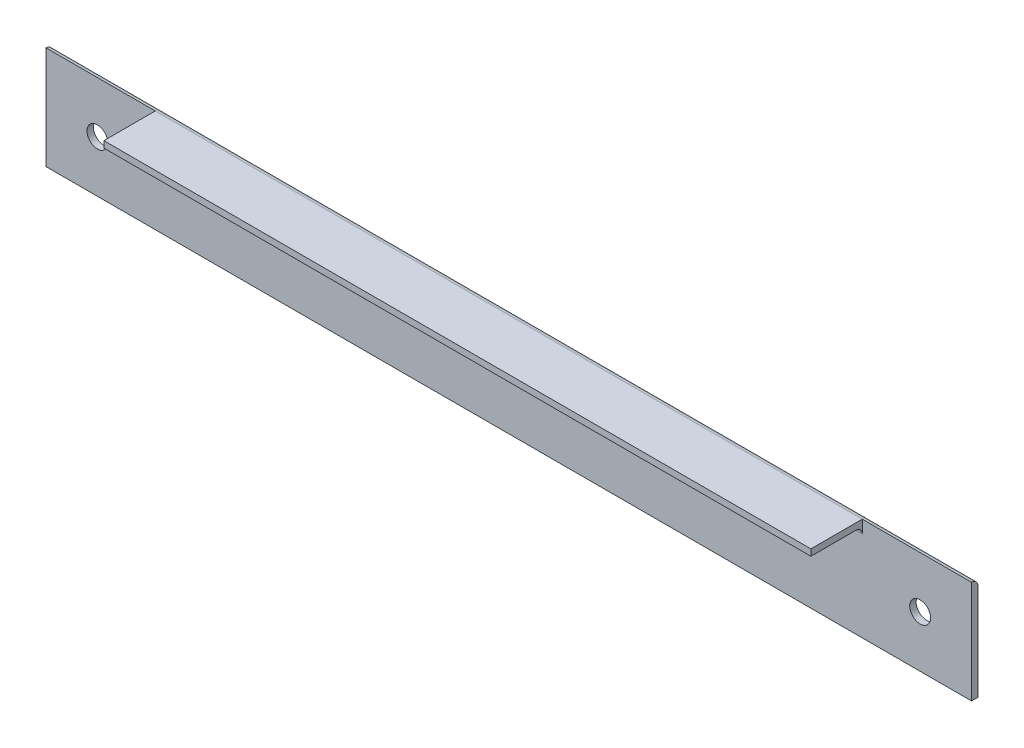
from build123d import *

# Parameters (mm, degrees)
SKETCH1_W          = 914.4
SKETCH1_H          = 101.6
EXTRUDE1_DEPTH     = 6.35
SKETCH2_R          = 10.31875
CUT_EXTRUDE1_DEPTH = 6.35
SKETCH3_R          = 10.31875
CUT_EXTRUDE2_DEPTH = 6.35
SKETCH4_W          = 698.5
SKETCH4_H          = 6.35
EXTRUDE4_DEPTH     = 50.8
FILLET2_R          = 6.35


with BuildPart() as part:
    # Sketch1 → Extrude1 (new body)
    with BuildSketch(Plane.XY):
        with Locations((-457.2, -50.8)):
            Rectangle(SKETCH1_W, SKETCH1_H)
    extrude(amount=EXTRUDE1_DEPTH)

    # Sketch2 → Cut-Extrude1 (cut)
    with BuildSketch(Plane.XY.offset(6.35)):
        with Locations((-863.6, -50.8)):
            Circle(SKETCH2_R)
    extrude(amount=-CUT_EXTRUDE1_DEPTH, mode=Mode.SUBTRACT)

    # Sketch3 → Cut-Extrude2 (cut)
    with BuildSketch(Plane.XY.offset(6.35)):
        with Locations((-50.8, -50.8)):
            Circle(SKETCH3_R)
    extrude(amount=-CUT_EXTRUDE2_DEPTH, mode=Mode.SUBTRACT)

    # Sketch4 → Extrude4 (add)
    with BuildSketch(Plane.XY.offset(6.35)):
        with Locations((-457.2, -3.175)):
            Rectangle(SKETCH4_W, SKETCH4_H)
    extrude(amount=EXTRUDE4_DEPTH)

    # Fillet2
    fillet2_edges = [part.edges().sort_by_distance(p)[0] for p in [
        (-457.2, -6.35, 6.35),
        (-457.2, 0, 0),
    ]]
    fillet(fillet2_edges, radius=FILLET2_R)


solid = part.part
